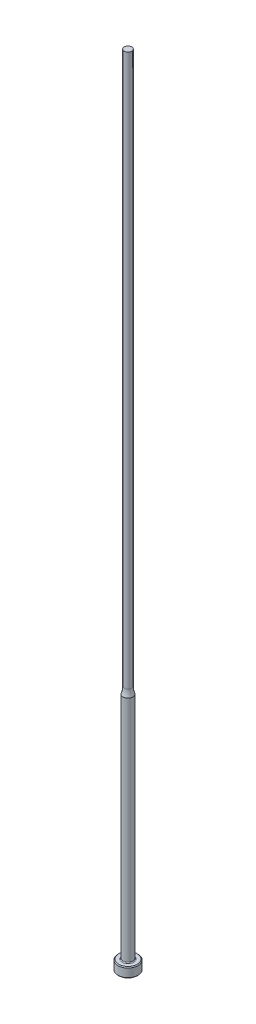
from build123d import *

# Parameters (mm, degrees)
CHAMFER1_SIZE = 0.254
FILLET1_R     = 0.254


with BuildPart() as part:
    # Sketch1 → Revolve1 (revolve)
    with BuildSketch(Plane.XY, mode=Mode.PRIVATE) as revolve1_sk:
        with BuildLine():
            Line((0, 0), (-3.175, 0))
            Line((-3.175, 0), (-3.175, 3.175))
            Line((-3.175, 3.175), (-1.5875, 3.175))
            Line((-1.5875, 3.175), (-1.5875, 76.2))
            ThreePointArc((-1.5875, 76.2), (-1.290157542, 77.287986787), (-1.18999, 78.411416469))
            Line((-1.18999, 78.411416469), (-1.18999, 254))
            Line((-1.18999, 254), (0, 254))
            Line((0, 254), (0, 0))
        make_face()
    revolve(revolve1_sk.sketch.rotate(Axis((0, 259.958771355, 0), (0, -1, 0)), 270), axis=Axis((0, 259.958771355, 0), (0, -1, 0)))

    # Chamfer1
    chamfer1_edges = [part.edges().sort_by_distance(p)[0] for p in [
        (0, 0, -3.175),
        (0, 3.175, -3.175),
    ]]
    chamfer(chamfer1_edges, length=CHAMFER1_SIZE)

    # Fillet1
    fillet1_edges = [part.edges().sort_by_distance(p)[0] for p in [
        (0, 3.175, -1.5875),
    ]]
    fillet(fillet1_edges, radius=FILLET1_R)


solid = part.part
